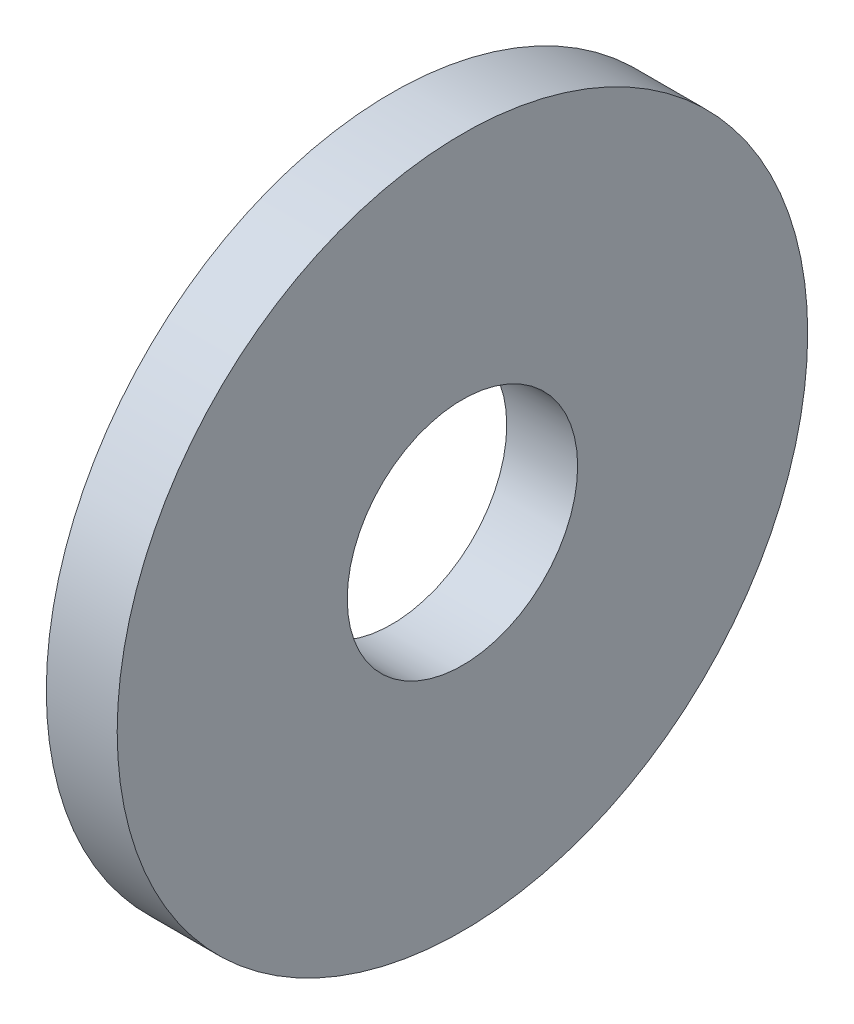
ISO-10303-21;
HEADER;
FILE_DESCRIPTION(('STEP AP214'),'2;1');
FILE_NAME('part.step','',(''),(''),'','','');
FILE_SCHEMA(('AUTOMOTIVE_DESIGN { 1 0 10303 214 1 1 1 1 }'));
ENDSEC;
DATA;
#1=APPLICATION_CONTEXT('core data for automotive mechanical design processes');
#2=APPLICATION_PROTOCOL_DEFINITION('international standard','automotive_design',2000,#1);
#3=PRODUCT_CONTEXT('',#1,'mechanical');
#4=PRODUCT('Part','Part','',(#3));
#5=PRODUCT_RELATED_PRODUCT_CATEGORY('part','',(#4));
#6=PRODUCT_DEFINITION_FORMATION('','',#4);
#7=PRODUCT_DEFINITION_CONTEXT('part definition',#1,'design');
#8=PRODUCT_DEFINITION('design','',#6,#7);
#9=PRODUCT_DEFINITION_SHAPE('','',#8);
#10=(LENGTH_UNIT() NAMED_UNIT(*) SI_UNIT(.MILLI.,.METRE.));
#11=(NAMED_UNIT(*) PLANE_ANGLE_UNIT() SI_UNIT($,.RADIAN.));
#12=(NAMED_UNIT(*) SI_UNIT($,.STERADIAN.) SOLID_ANGLE_UNIT());
#13=UNCERTAINTY_MEASURE_WITH_UNIT(LENGTH_MEASURE(1.E-05),#10,'distance_accuracy_value','');
#14=(GEOMETRIC_REPRESENTATION_CONTEXT(3) GLOBAL_UNCERTAINTY_ASSIGNED_CONTEXT((#13)) GLOBAL_UNIT_ASSIGNED_CONTEXT((#10,
#11,#12)) REPRESENTATION_CONTEXT('',''));
#15=CARTESIAN_POINT('',(0.,0.,0.));
#16=DIRECTION('',(0.,0.,1.));
#17=DIRECTION('',(1.,0.,0.));
#18=AXIS2_PLACEMENT_3D('',#15,#16,#17);
#19=CARTESIAN_POINT('',(2.,0.,0.));
#20=DIRECTION('',(1.,0.,0.));
#21=DIRECTION('',(0.,0.,-1.));
#22=AXIS2_PLACEMENT_3D('',#19,#20,#21);
#23=PLANE('',#22);
#24=CARTESIAN_POINT('',(2.,0.,0.));
#25=DIRECTION('',(1.,0.,0.));
#26=DIRECTION('',(0.,0.,-1.));
#27=AXIS2_PLACEMENT_3D('',#24,#25,#26);
#28=CIRCLE('',#27,9.74);
#29=CARTESIAN_POINT('',(2.,0.,-9.74));
#30=VERTEX_POINT('',#29);
#31=EDGE_CURVE('E10',#30,#30,#28,.T.);
#32=ORIENTED_EDGE('',*,*,#31,.T.);
#33=EDGE_LOOP('',(#32));
#34=FACE_BOUND('',#33,.T.);
#35=CARTESIAN_POINT('',(2.,0.,0.));
#36=DIRECTION('',(1.,0.,0.));
#37=DIRECTION('',(0.,0.,-1.));
#38=AXIS2_PLACEMENT_3D('',#35,#36,#37);
#39=CIRCLE('',#38,3.25);
#40=CARTESIAN_POINT('',(2.,0.,-3.25));
#41=VERTEX_POINT('',#40);
#42=EDGE_CURVE('E43',#41,#41,#39,.T.);
#43=ORIENTED_EDGE('',*,*,#42,.F.);
#44=EDGE_LOOP('',(#43));
#45=FACE_BOUND('',#44,.T.);
#46=ADVANCED_FACE('F32',(#34,#45),#23,.T.);
#47=CARTESIAN_POINT('',(0.,0.,0.));
#48=DIRECTION('',(1.,0.,0.));
#49=DIRECTION('',(0.,0.,-1.));
#50=AXIS2_PLACEMENT_3D('',#47,#48,#49);
#51=PLANE('',#50);
#52=CARTESIAN_POINT('',(0.,0.,0.));
#53=DIRECTION('',(1.,0.,0.));
#54=DIRECTION('',(0.,0.,-1.));
#55=AXIS2_PLACEMENT_3D('',#52,#53,#54);
#56=CIRCLE('',#55,9.74);
#57=CARTESIAN_POINT('',(0.,0.,-9.74));
#58=VERTEX_POINT('',#57);
#59=EDGE_CURVE('E36',#58,#58,#56,.T.);
#60=ORIENTED_EDGE('',*,*,#59,.F.);
#61=EDGE_LOOP('',(#60));
#62=FACE_BOUND('',#61,.T.);
#63=CARTESIAN_POINT('',(0.,0.,0.));
#64=DIRECTION('',(1.,0.,0.));
#65=DIRECTION('',(0.,0.,-1.));
#66=AXIS2_PLACEMENT_3D('',#63,#64,#65);
#67=CIRCLE('',#66,3.25);
#68=CARTESIAN_POINT('',(0.,0.,-3.25));
#69=VERTEX_POINT('',#68);
#70=EDGE_CURVE('E45',#69,#69,#67,.T.);
#71=ORIENTED_EDGE('',*,*,#70,.T.);
#72=EDGE_LOOP('',(#71));
#73=FACE_BOUND('',#72,.T.);
#74=ADVANCED_FACE('F55',(#62,#73),#51,.F.);
#75=CARTESIAN_POINT('',(2.,0.,0.));
#76=DIRECTION('',(-1.,0.,0.));
#77=DIRECTION('',(0.,0.,1.));
#78=AXIS2_PLACEMENT_3D('',#75,#76,#77);
#79=CYLINDRICAL_SURFACE('',#78,9.74);
#80=ORIENTED_EDGE('',*,*,#31,.F.);
#81=EDGE_LOOP('',(#80));
#82=FACE_BOUND('',#81,.T.);
#83=ORIENTED_EDGE('',*,*,#59,.T.);
#84=EDGE_LOOP('',(#83));
#85=FACE_BOUND('',#84,.T.);
#86=ADVANCED_FACE('F34',(#82,#85),#79,.T.);
#87=CARTESIAN_POINT('',(2.,0.,0.));
#88=DIRECTION('',(-1.,0.,0.));
#89=DIRECTION('',(0.,0.,1.));
#90=AXIS2_PLACEMENT_3D('',#87,#88,#89);
#91=CYLINDRICAL_SURFACE('',#90,3.25);
#92=ORIENTED_EDGE('',*,*,#42,.T.);
#93=EDGE_LOOP('',(#92));
#94=FACE_BOUND('',#93,.T.);
#95=ORIENTED_EDGE('',*,*,#70,.F.);
#96=EDGE_LOOP('',(#95));
#97=FACE_BOUND('',#96,.T.);
#98=ADVANCED_FACE('F51',(#94,#97),#91,.F.);
#99=CLOSED_SHELL('',(#46,#74,#86,#98));
#100=MANIFOLD_SOLID_BREP('B2',#99);
#101=ADVANCED_BREP_SHAPE_REPRESENTATION('',(#18,#100),#14);
#102=SHAPE_DEFINITION_REPRESENTATION(#9,#101);
ENDSEC;
END-ISO-10303-21;
